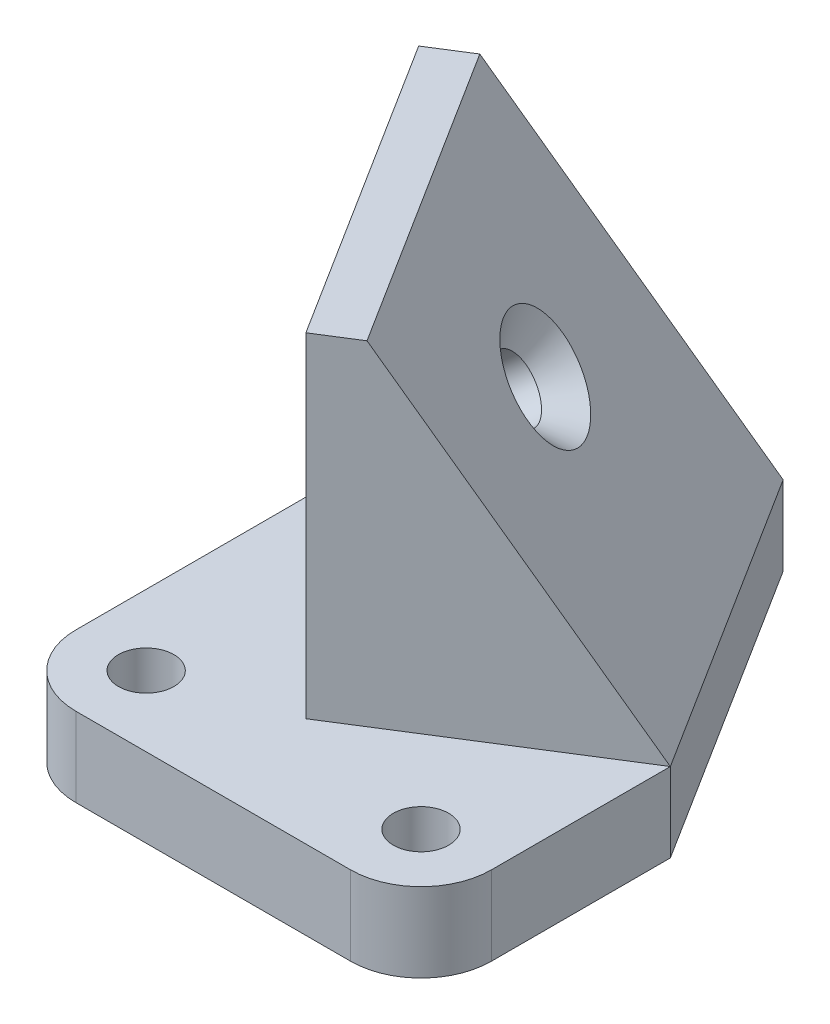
from build123d import *

# Parameters (mm, degrees)
BASE_EXTRUDE_DEPTH                               = 14.2875
BOSS_EXTRUDE1_DEPTH                              = 60.325
CUT_EXTRUDE1_DEPTH                               = 115.691718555
CSK_FOR_M10_FLAT_HEAD_MACHINE_SCREW1_D           = 11
CSK_FOR_M10_FLAT_HEAD_MACHINE_SCREW1_DEPTH       = 25.4
CSK_FOR_M10_FLAT_HEAD_MACHINE_SCREW1_CSINK_D     = 20
CSK_FOR_M10_FLAT_HEAD_MACHINE_SCREW1_CSINK_ANGLE = 90
CSK_FOR_M10_FLAT_HEAD_MACHINE_SCREW1_TIP         = 3.304733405
FILLET1_R                                        = 12.7
F_10_0_10_DIAMETER_HOLE1_D                       = 10


with BuildPart() as part:
    # Sketch1 → Base-Extrude (new body)
    with BuildSketch(Plane(origin=(0, 0, 0), x_dir=(1, 0, 0), z_dir=(0, 1, 0))):
        Polygon((0, 0), (0, 45), (-34.641016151, 100), (-75, 74.580432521), (-75, 0), align=None)
    extrude(amount=BASE_EXTRUDE_DEPTH)

    # Sketch2 → Boss-Extrude1 (add)
    with BuildSketch(Plane(origin=(0, 14.2875, 0), x_dir=(-1, 0, 0), z_dir=(0, 1, 0))):
        Polygon((34.641016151, -100), (75, -74.580432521), (40.358983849, -19.580432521), (0, -45), align=None)
    extrude(amount=BOSS_EXTRUDE1_DEPTH)

    # Sketch3 → Cut-Extrude1 (cut, through all)
    with BuildSketch(Plane(origin=(-20.292666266, 0, -32.218934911), x_dir=(0.846153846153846, 0, -0.5329387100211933), z_dir=(0.5329387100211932, 0, 0.8461538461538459))):
        Polygon((-138.006469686, 260.451535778), (-15.714738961, 74.6125), (23.982241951, 14.2875), (146.273972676, -171.551535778), (517.952044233, 73.031925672), (233.67160187, 505.034997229), align=None)
    extrude(amount=-CUT_EXTRUDE1_DEPTH, mode=Mode.SUBTRACT)

    # CSK for M10 Flat Head Machine Screw1
    with Locations(Plane(origin=(19.712140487, 15.330086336, -12.415428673), x_dir=(-0.36778462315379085, -0.25201220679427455, -0.8951113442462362), z_dir=(0.7068403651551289, 0.549708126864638, -0.4451939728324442))):
        with Locations((53.6091088, 60.43353944)):
            CounterSinkHole(CSK_FOR_M10_FLAT_HEAD_MACHINE_SCREW1_D / 2, CSK_FOR_M10_FLAT_HEAD_MACHINE_SCREW1_CSINK_D / 2, depth=CSK_FOR_M10_FLAT_HEAD_MACHINE_SCREW1_DEPTH, counter_sink_angle=CSK_FOR_M10_FLAT_HEAD_MACHINE_SCREW1_CSINK_ANGLE)
            with Locations((0, 0, -(CSK_FOR_M10_FLAT_HEAD_MACHINE_SCREW1_DEPTH + CSK_FOR_M10_FLAT_HEAD_MACHINE_SCREW1_TIP / 2))):  # 118° drill point
                Cone(0, CSK_FOR_M10_FLAT_HEAD_MACHINE_SCREW1_D / 2, CSK_FOR_M10_FLAT_HEAD_MACHINE_SCREW1_TIP, mode=Mode.SUBTRACT)

    # Fillet1
    fillet1_edges = [part.edges().sort_by_distance(p)[0] for p in [
        (0, 7.14375, 0),
        (-75, 7.14375, 0),
    ]]
    fillet(fillet1_edges, radius=FILLET1_R)

    # 10.0 _10_ Diameter Hole1 (through all)
    with Locations(Plane(origin=(0, 14.2875, 0), x_dir=(-1, 0, 0), z_dir=(0, 1, 0))):
        with Locations((12.7, -12.7), (62.3, -12.7)):
            Hole(F_10_0_10_DIAMETER_HOLE1_D / 2)


solid = part.part
